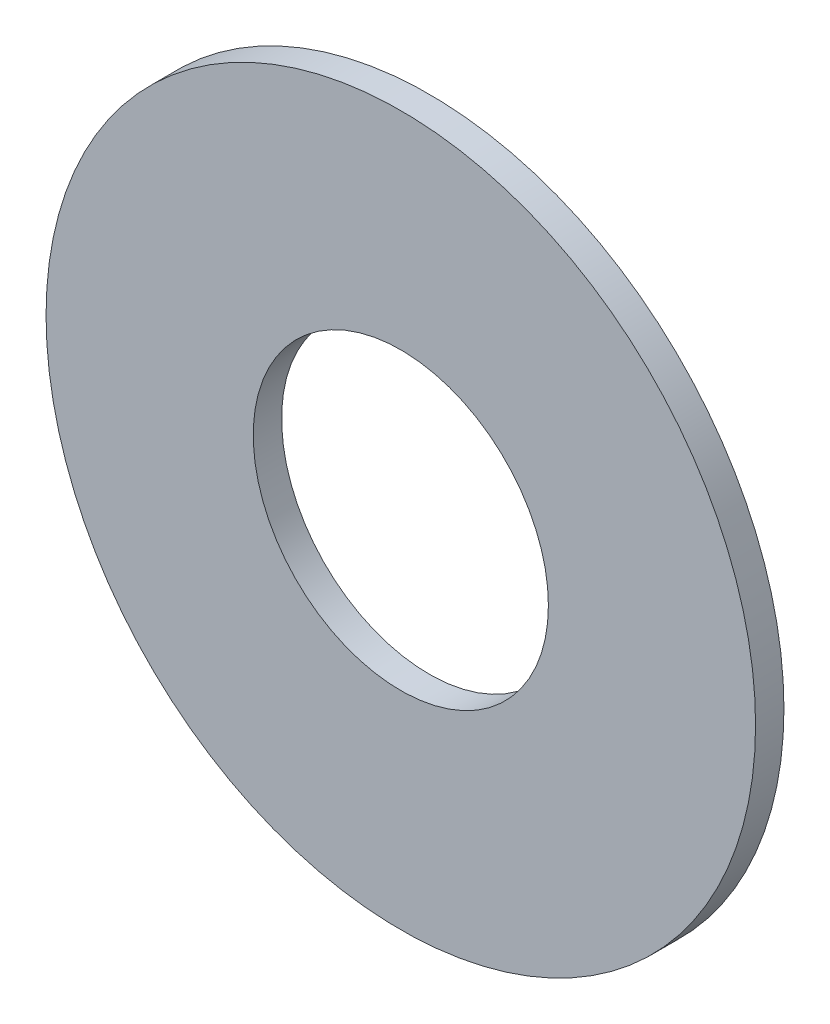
from build123d import *

# Parameters (mm, degrees)
SKETCH1_R          = 9.525
SKETCH1_R_2        = 3.9624
BASE_EXTRUDE_DEPTH = 0.762


with BuildPart() as part:
    # Sketch1 → Base-Extrude (new body)
    with BuildSketch(Plane.XY):
        Circle(SKETCH1_R)
        Circle(SKETCH1_R_2, mode=Mode.SUBTRACT)
    extrude(amount=-BASE_EXTRUDE_DEPTH)


solid = part.part
